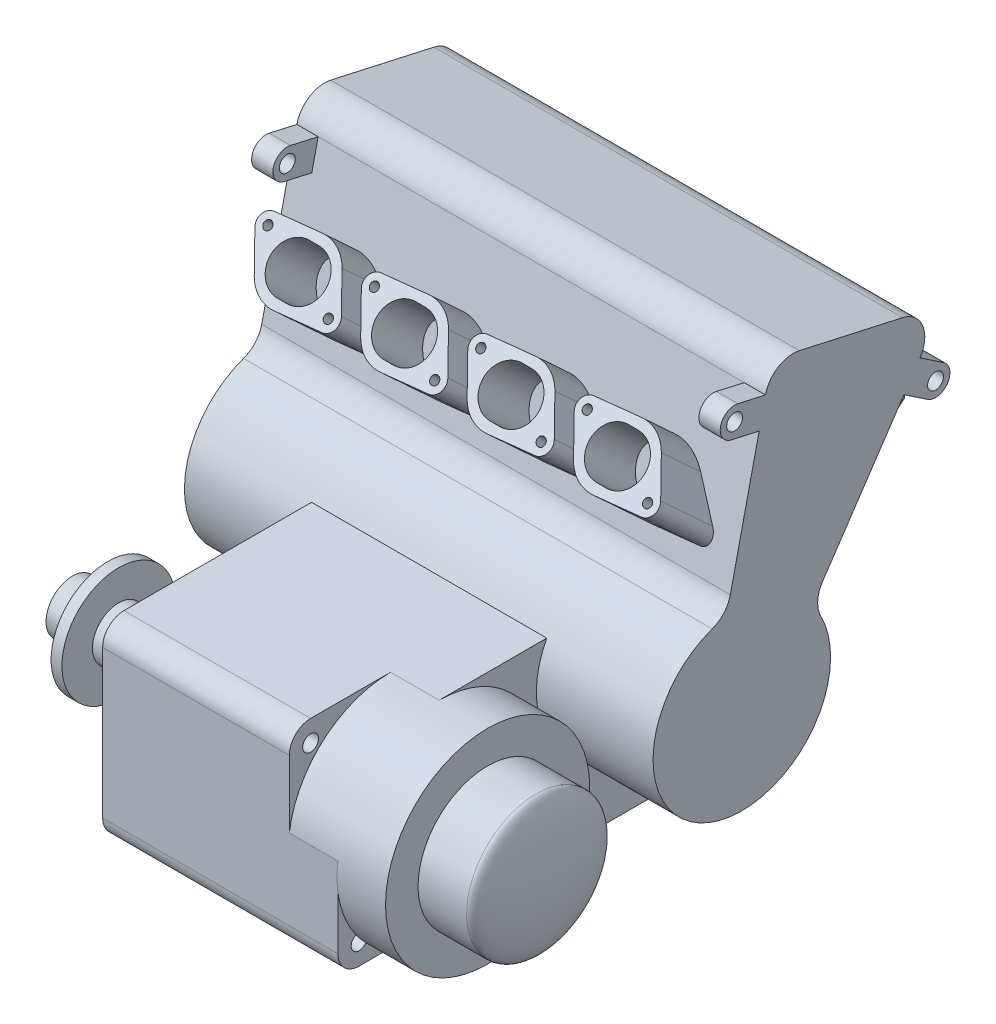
from build123d import *

# Parameters (mm, degrees)
BOSS_EXTRUDE1_DEPTH               = 165.1
BOSS_EXTRUDE2_DEPTH               = 180
BOSS_EXTRUDE2_DEPTH_BACK          = 49.2
SKETCH2_W                         = 165.7564471
SKETCH2_H                         = 134.053850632
CUT_EXTRUDE1_DEPTH                = 34.2
BOSS_EXTRUDE4_START               = 34.2
SKETCH5_R                         = 71.944295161
BOSS_EXTRUDE4_DEPTH               = 34.2
SKETCH6_R                         = 49.022837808
BOSS_EXTRUDE5_DEPTH               = 34.2
DOME1_FACE_RADIUS                 = 49.022837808
DOME1_HEIGHT                      = 10
SKETCH7_R                         = 18.543468
BOSS_EXTRUDE6_DEPTH               = 60
SKETCH14_R                        = 5.6
BOSS_EXTRUDE8_DEPTH               = 15
SKETCH17_R                        = 5.6
BOSS_EXTRUDE10_DEPTH              = 15
FILLET1_R                         = 15
SKETCH18_R                        = 5.6
CUT_EXTRUDE3_DEPTH                = 432.32760168
SKETCH20_R                        = 30
BOSS_EXTRUDE11_DEPTH              = 40
CHAMFER1_SIZE                     = 5
SKETCH21_R                        = 40
BOSS_EXTRUDE12_DEPTH              = 7.62
SKETCH22_R                        = 18.543468
BOSS_EXTRUDE13_DEPTH              = 25
BOSS_EXTRUDE14_REACH              = 488.755
F_6_0_6_DIAMETER_HOLE1_AT_2_COUNT = 2
F_6_0_6_DIAMETER_HOLE1_AT_2_PITCH = 64.897
LPATTERN2_COUNT                   = 4
LPATTERN2_PITCH                   = 75
BOSS_EXTRUDE15_REACH              = 441.559
F_6_0_6_DIAMETER_HOLE2_AT_2_COUNT = 2
F_6_0_6_DIAMETER_HOLE2_AT_2_PITCH = 64.897
LPATTERN3_COUNT                   = 4
LPATTERN3_PITCH                   = 75


with BuildPart() as part:
    # Sketch1 → Boss-Extrude1 (new, symmetric)
    with BuildSketch(Plane(origin=(0, 0, 0), x_dir=(0, 0, -1), z_dir=(1, 0, 0))):
        with BuildLine():
            Line((79.257437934, 153.498629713), (147.964141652, 255.806680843))
            ThreePointArc((147.964141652, 255.806680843), (149.934350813, 274.374666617), (135.715288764, 286.477149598))
            Line((135.715288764, 286.477149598), (62.965803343, 302.705880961))
            ThreePointArc((62.965803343, 302.705880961), (47.912093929, 300.083225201), (39.103843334, 287.596944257))
            Line((39.103843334, 287.596944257), (14.330273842, 178.043503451))
            ThreePointArc((14.330273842, 178.043503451), (9.777378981, 169.174663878), (1.508830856, 163.605437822))
            ThreePointArc((1.508830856, 163.605437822), (-0.657909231, 46.516874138), (78.067588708, 133.215908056))
            ThreePointArc((78.067588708, 133.215908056), (75.89512248, 143.519612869), (79.257437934, 153.498629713))
        make_face()
    extrude(amount=BOSS_EXTRUDE1_DEPTH, both=True)

    # Sketch2 → Boss-Extrude2 (add, two sides: drawn at the far end of the back side and taken through both)
    with BuildSketch(Plane.XY.offset(-BOSS_EXTRUDE2_DEPTH_BACK)):
        with Locations((0, 67.026925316)):
            Rectangle(SKETCH2_W, SKETCH2_H)
    extrude(amount=BOSS_EXTRUDE2_DEPTH + BOSS_EXTRUDE2_DEPTH_BACK)

    # Sketch4 → Cut-Extrude1 (cut)
    with BuildSketch(Plane(origin=(82.87822355, 0, 0), x_dir=(0, 0, -1), z_dir=(1, 0, 0))):
        with BuildLine():
            Line((-180, 71.641810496), (-180, 134.053850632))
            Line((-180, 134.053850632), (-108.689988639, 134.053850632))
            ThreePointArc((-108.689988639, 134.053850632), (-156.072423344, 116.247217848), (-180, 71.641810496))
        make_face()
    extrude(amount=-CUT_EXTRUDE1_DEPTH, mode=Mode.SUBTRACT)

    # Sketch5 → Boss-Extrude4 (add)
    with BuildSketch(Plane(origin=(82.87822355, 0, 0), x_dir=(0, 0, -1), z_dir=(1, 0, 0)).offset(BOSS_EXTRUDE4_START)):
        with Locations(Location((-108.689988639, 62.109555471, 0), (0, 0, 90))):
            Circle(SKETCH5_R)
    extrude(amount=-BOSS_EXTRUDE4_DEPTH)

    # Sketch6 → Boss-Extrude5 (add)
    with BuildSketch(Plane(origin=(117.07822355, 0, 0), x_dir=(0, 0, -1), z_dir=(1, 0, 0))):
        with Locations(Location((-108.689988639, 62.109555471, 0), (0, 0, 90))):
            Circle(SKETCH6_R)
    extrude(amount=BOSS_EXTRUDE5_DEPTH)

    # Dome1: an elliptical dome of height H over a round flat face of radius A is half a spheroid: the quarter ellipse of half axes A and H revolved about the face's axis
    with BuildSketch(Plane((151.27822355, 62.109555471, 108.689988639), x_dir=(0, 0, 1), z_dir=(0, 1, 0)), mode=Mode.PRIVATE) as dome1_quarter:
        Ellipse(DOME1_FACE_RADIUS, DOME1_HEIGHT)
        Rectangle(DOME1_FACE_RADIUS, DOME1_HEIGHT, align=(Align.MIN, Align.MIN), mode=Mode.INTERSECT)
    revolve(dome1_quarter.sketch, axis=Axis((151.27822355, 62.109555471, 108.689988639), (1, 0, 0)))

    # Sketch7 → Boss-Extrude6 (add)
    with BuildSketch(Plane.ZY.offset(82.87822355)):
        with Locations((108.689988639, 62.109555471)):
            Circle(SKETCH7_R)
    extrude(amount=BOSS_EXTRUDE6_DEPTH)

    # Sketch14 → Boss-Extrude8 (add)
    with BuildSketch(Plane(origin=(165.1, 0, 0), x_dir=(0, 0, -1), z_dir=(1, 0, 0))):
        with BuildLine():
            Line((34.621998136, 267.777371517), (15.114544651, 272.188636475))
            ThreePointArc((15.114544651, 272.188636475), (7.44568088, 284.339345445), (19.596389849, 292.008209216))
            Line((19.596389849, 292.008209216), (39.103843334, 287.596944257))
            Line((39.103843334, 287.596944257), (34.621998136, 267.777371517))
        make_face()
        with Locations((17.35546725, 282.098422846)):
            Circle(SKETCH14_R, mode=Mode.SUBTRACT)
    boss_extrude8 = extrude(amount=-BOSS_EXTRUDE8_DEPTH)

    # Sketch17 → Boss-Extrude10 (add)
    with BuildSketch(Plane(origin=(165.1, 0, 0), x_dir=(0, 0, -1), z_dir=(1, 0, 0))):
        with BuildLine():
            Line((147.964141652, 255.806680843), (164.567501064, 244.656413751))
            ThreePointArc((164.567501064, 244.656413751), (167.337671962, 230.557571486), (153.238829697, 227.787400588))
            Line((153.238829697, 227.787400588), (136.635470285, 238.937667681))
            Line((136.635470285, 238.937667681), (147.964141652, 255.806680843))
        make_face()
        with Locations((158.90316538, 236.221907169)):
            Circle(SKETCH17_R, mode=Mode.SUBTRACT)
    boss_extrude10 = extrude(amount=-BOSS_EXTRUDE10_DEPTH)

    # Mirror1: Boss-Extrude8, Boss-Extrude10 across plane
    add(boss_extrude8.mirror(Plane(origin=(0, 0, 0), x_dir=(0, 0, 1), z_dir=(1, 0, 0))))
    add(boss_extrude10.mirror(Plane(origin=(0, 0, 0), x_dir=(0, 0, 1), z_dir=(1, 0, 0))))

    # Fillet1
    fillet1_edges = [part.edges().sort_by_distance(p)[0] for p in [
        (0, 0, 180),
        (-17.1, 134.053850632, 180),
    ]]
    fillet(fillet1_edges, radius=FILLET1_R)

    # Sketch18 → Cut-Extrude3 (cut, through all)
    with BuildSketch(Plane(origin=(82.87822355, 0, 0), x_dir=(0, 0, -1), z_dir=(1, 0, 0))):
        with Locations(Location((-165, 15, 0), (0, 0, 112.544544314))):
            Circle(SKETCH18_R)
        with Locations(Location((-165, 119.053850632, 0), (0, 0, 90))):
            Circle(SKETCH18_R)
    extrude(amount=-CUT_EXTRUDE3_DEPTH, mode=Mode.SUBTRACT)

    # Sketch20 → Boss-Extrude11 (add)
    with BuildSketch(Plane(origin=(0, 0, -49.2), x_dir=(-1, 0, 0), z_dir=(0, 0, -1))):
        with Locations(Location((32.87822355, 50, 0), (0, 0, 183.579134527))):
            Circle(SKETCH20_R)
    extrude(amount=BOSS_EXTRUDE11_DEPTH)

    # Chamfer1
    chamfer1_edges = [part.edges().sort_by_distance(p)[0] for p in [
        (-62.819709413, 51.872811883, -89.2),
    ]]
    chamfer(chamfer1_edges, length=CHAMFER1_SIZE)

    # Sketch21 → Boss-Extrude12 (add)
    with BuildSketch(Plane.ZY.offset(142.87822355)):
        with Locations(Location((108.689988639, 62.109555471, 0), (0, 0, 180))):
            Circle(SKETCH21_R)
    extrude(amount=BOSS_EXTRUDE12_DEPTH)

    # Sketch22 → Boss-Extrude13 (add)
    with BuildSketch(Plane.ZY.offset(150.49822355)):
        with Locations((108.689988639, 62.109555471)):
            Circle(SKETCH22_R)
    extrude(amount=BOSS_EXTRUDE13_DEPTH)

    # Boss-Extrude14: up to this plane
    boss_extrude14_end = Plane(origin=(165.1, 153.498629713, -79.257437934), z_dir=(0, 0.5575133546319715, 0.8301679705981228))
    # Sketch29 → Boss-Extrude14 (add, up to the surface)
    with BuildSketch(Plane(origin=(0, 58.265497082, -201.654226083), x_dir=(-1, 0, 0), z_dir=(0, 0.277582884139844, -0.960701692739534)), mode=Mode.PRIVATE) as boss_extrude14_sk1:
        with BuildLine():
            Line((137.506545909, 169.699124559), (151.337183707, 148.651337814))
            ThreePointArc((151.337183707, 148.651337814), (151.812129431, 141.11474913), (145.566357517, 136.870214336))
            Line((145.566357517, 136.870214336), (113.590067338, 134.355754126))
            ThreePointArc((113.590067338, 134.355754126), (101.741955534, 136.616019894), (92.693454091, 144.591681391))
            Line((92.693454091, 144.591681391), (78.862816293, 165.639468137))
            ThreePointArc((78.862816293, 165.639468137), (78.387870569, 173.17605682), (84.633642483, 177.420591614))
            Line((84.633642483, 177.420591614), (116.609932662, 179.935051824))
            ThreePointArc((116.609932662, 179.935051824), (128.458044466, 177.674786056), (137.506545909, 169.699124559))
        make_face()
        with BuildLine():
            Line((111.798, 140.635402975), (118.402, 140.635402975))
            ThreePointArc((118.402, 140.635402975), (134.912, 157.145402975), (118.402, 173.655402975))
            Line((118.402, 173.655402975), (111.798, 173.655402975))
            ThreePointArc((111.798, 173.655402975), (95.288, 157.145402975), (111.798, 140.635402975))
        make_face(mode=Mode.SUBTRACT)
    boss_extrude14_tool1 = split(extrude(boss_extrude14_sk1.sketch, amount=-BOSS_EXTRUDE14_REACH, mode=Mode.PRIVATE), bisect_by=boss_extrude14_end, keep=Keep.BOTH, mode=Mode.PRIVATE)
    boss_extrude14 = boss_extrude14_tool1.solids().sort_by_distance((-143.687952, 210.722104, -157.603773))[0]
    add(boss_extrude14)

    # Sketch30 → 6.0 _6_ Diameter Hole1 (revolve, cut)
    with BuildSketch(Plane(origin=(-144.969001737, 197.054961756, -161.552725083), x_dir=(0, 0.9607016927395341, 0.27758288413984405), z_dir=(1, 0, 0))):
        Polygon((0, 0), (0, 21.802581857), (3, 20), (3, 0), align=None)
    f_6_0_6_diameter_hole1 = revolve(axis=Axis((-144.969001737, 198.81761307, -167.653180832), (0, -0.27758288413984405, 0.960701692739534)), mode=Mode.SUBTRACT)

    # 6.0 _6_ Diameter Hole1 at 2: 6.0 _6_ Diameter Hole1 ×2
    with Locations(*[Vector(0.9205048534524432, 0.3753760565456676, 0.10846027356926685) * (i * F_6_0_6_DIAMETER_HOLE1_AT_2_PITCH) for i in range(1, F_6_0_6_DIAMETER_HOLE1_AT_2_COUNT)]):
        add(f_6_0_6_diameter_hole1, mode=Mode.SUBTRACT)

    # LPattern2: Boss-Extrude14, 6.0 _6_ Diameter Hole1 ×4
    with Locations(*[(i * LPATTERN2_PITCH, 0, 0) for i in range(1, LPATTERN2_COUNT)]):
        add(boss_extrude14)
        add(f_6_0_6_diameter_hole1, mode=Mode.SUBTRACT)

    # LPattern2 copy 1 sketch → LPattern2 copy 1 (revolve, cut)
    with BuildSketch(Plane(origin=(-10.230998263, 221.415741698, -154.513978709), x_dir=(0, 0.9607016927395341, 0.27758288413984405), z_dir=(1, 0, 0))):
        Polygon((0, 0), (0, 21.802581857), (3, 20), (3, 0), align=None)
    revolve(axis=Axis((-10.230998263, 223.178393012, -160.614434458), (0, -0.27758288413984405, 0.960701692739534)), mode=Mode.SUBTRACT)

    # LPattern2 copy 2 sketch → LPattern2 copy 2 (revolve, cut)
    with BuildSketch(Plane(origin=(64.769001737, 221.415741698, -154.513978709), x_dir=(0, 0.9607016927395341, 0.27758288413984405), z_dir=(1, 0, 0))):
        Polygon((0, 0), (0, 21.802581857), (3, 20), (3, 0), align=None)
    revolve(axis=Axis((64.769001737, 223.178393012, -160.614434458), (0, -0.27758288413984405, 0.960701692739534)), mode=Mode.SUBTRACT)

    # LPattern2 copy 3 sketch → LPattern2 copy 3 (revolve, cut)
    with BuildSketch(Plane(origin=(139.769001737, 221.415741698, -154.513978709), x_dir=(0, 0.9607016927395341, 0.27758288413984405), z_dir=(1, 0, 0))):
        Polygon((0, 0), (0, 21.802581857), (3, 20), (3, 0), align=None)
    revolve(axis=Axis((139.769001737, 223.178393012, -160.614434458), (0, -0.27758288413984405, 0.960701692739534)), mode=Mode.SUBTRACT)

    # Boss-Extrude15: up to this plane
    boss_extrude15_end = Plane(origin=(165.1, 287.596944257, -39.103843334), z_dir=(0, -0.22056324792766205, -0.9753726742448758))
    # Sketch32 → Boss-Extrude15 (add, up to the surface)
    with BuildSketch(Plane(origin=(110.1, 266.212311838, -7.631333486), x_dir=(-1, 0, 0), z_dir=(0, 0.678699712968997, 0.734415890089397)), mode=Mode.PRIVATE) as boss_extrude15_sk1:
        with BuildLine():
            Line((247.606545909, 38.563152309), (261.437183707, 17.515365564))
            ThreePointArc((261.437183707, 17.515365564), (261.912129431, 9.97877688), (255.666357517, 5.734242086))
            Line((255.666357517, 5.734242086), (223.690067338, 3.219781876))
            ThreePointArc((223.690067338, 3.219781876), (211.841955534, 5.480047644), (202.793454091, 13.455709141))
            Line((202.793454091, 13.455709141), (188.962816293, 34.503495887))
            ThreePointArc((188.962816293, 34.503495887), (188.487870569, 42.04008457), (194.733642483, 46.284619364))
            Line((194.733642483, 46.284619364), (226.709932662, 48.799079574))
            ThreePointArc((226.709932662, 48.799079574), (238.558044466, 46.538813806), (247.606545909, 38.563152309))
        make_face()
        with BuildLine():
            Line((221.898, 9.499430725), (228.502, 9.499430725))
            ThreePointArc((228.502, 9.499430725), (245.012, 26.009430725), (228.502, 42.519430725))
            Line((228.502, 42.519430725), (221.898, 42.519430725))
            ThreePointArc((221.898, 42.519430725), (205.388, 26.009430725), (221.898, 9.499430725))
        make_face(mode=Mode.SUBTRACT)
    boss_extrude15_tool1 = split(extrude(boss_extrude15_sk1.sketch, amount=-BOSS_EXTRUDE15_REACH, mode=Mode.PRIVATE), bisect_by=boss_extrude15_end, keep=Keep.BOTH, mode=Mode.PRIVATE)
    boss_extrude15 = boss_extrude15_tool1.solids().sort_by_distance((-102.128265, 261.608481, -3.376771))[0]
    add(boss_extrude15)

    # Sketch34 → 6.0 _6_ Diameter Hole2 (revolve, cut)
    with BuildSketch(Plane(origin=(-85.230998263, 237.799178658, 18.626248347), x_dir=(0, -0.7344158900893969, 0.678699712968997), z_dir=(1, 0, 0))):
        Polygon((0, 0), (0, 21.802581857), (3, 20), (3, 0), align=None)
    f_6_0_6_diameter_hole2 = revolve(axis=Axis((-85.230998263, 242.108921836, 23.289789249), (0, -0.678699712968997, -0.734415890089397)), mode=Mode.SUBTRACT)

    # 6.0 _6_ Diameter Hole2 at 2: 6.0 _6_ Diameter Hole2 ×2
    with Locations(*[Vector(-0.9205048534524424, 0.2869591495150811, -0.26518910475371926) * (i * F_6_0_6_DIAMETER_HOLE2_AT_2_PITCH) for i in range(1, F_6_0_6_DIAMETER_HOLE2_AT_2_COUNT)]):
        add(f_6_0_6_diameter_hole2, mode=Mode.SUBTRACT)

    # LPattern3: Boss-Extrude15, 6.0 _6_ Diameter Hole2 ×4
    with Locations(*[(i * LPATTERN3_PITCH, 0, 0) for i in range(1, LPATTERN3_COUNT)]):
        add(boss_extrude15)
        add(f_6_0_6_diameter_hole2, mode=Mode.SUBTRACT)

    # LPattern3 copy 1 sketch → LPattern3 copy 1 (revolve, cut)
    with BuildSketch(Plane(origin=(-69.969001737, 256.421966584, 1.416271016), x_dir=(0, -0.7344158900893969, 0.678699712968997), z_dir=(1, 0, 0))):
        Polygon((0, 0), (0, 21.802581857), (3, 20), (3, 0), align=None)
    revolve(axis=Axis((-69.969001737, 260.731709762, 6.079811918), (0, -0.678699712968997, -0.734415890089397)), mode=Mode.SUBTRACT)

    # LPattern3 copy 2 sketch → LPattern3 copy 2 (revolve, cut)
    with BuildSketch(Plane(origin=(5.030998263, 256.421966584, 1.416271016), x_dir=(0, -0.7344158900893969, 0.678699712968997), z_dir=(1, 0, 0))):
        Polygon((0, 0), (0, 21.802581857), (3, 20), (3, 0), align=None)
    revolve(axis=Axis((5.030998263, 260.731709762, 6.079811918), (0, -0.678699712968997, -0.734415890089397)), mode=Mode.SUBTRACT)

    # LPattern3 copy 3 sketch → LPattern3 copy 3 (revolve, cut)
    with BuildSketch(Plane(origin=(80.030998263, 256.421966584, 1.416271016), x_dir=(0, -0.7344158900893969, 0.678699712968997), z_dir=(1, 0, 0))):
        Polygon((0, 0), (0, 21.802581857), (3, 20), (3, 0), align=None)
    revolve(axis=Axis((80.030998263, 260.731709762, 6.079811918), (0, -0.678699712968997, -0.734415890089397)), mode=Mode.SUBTRACT)


solid = part.part
